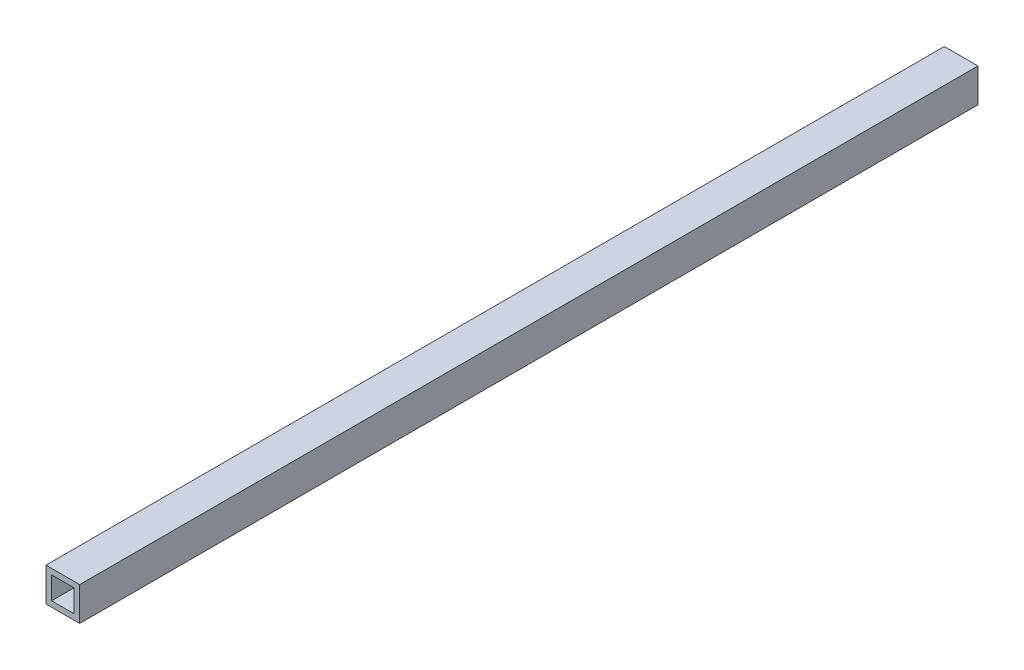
ISO-10303-21;
HEADER;
FILE_DESCRIPTION(('STEP AP214'),'2;1');
FILE_NAME('part.step','',(''),(''),'','','');
FILE_SCHEMA(('AUTOMOTIVE_DESIGN { 1 0 10303 214 1 1 1 1 }'));
ENDSEC;
DATA;
#1=APPLICATION_CONTEXT('core data for automotive mechanical design processes');
#2=APPLICATION_PROTOCOL_DEFINITION('international standard','automotive_design',2000,#1);
#3=PRODUCT_CONTEXT('',#1,'mechanical');
#4=PRODUCT('Part','Part','',(#3));
#5=PRODUCT_RELATED_PRODUCT_CATEGORY('part','',(#4));
#6=PRODUCT_DEFINITION_FORMATION('','',#4);
#7=PRODUCT_DEFINITION_CONTEXT('part definition',#1,'design');
#8=PRODUCT_DEFINITION('design','',#6,#7);
#9=PRODUCT_DEFINITION_SHAPE('','',#8);
#10=(LENGTH_UNIT() NAMED_UNIT(*) SI_UNIT(.MILLI.,.METRE.));
#11=(NAMED_UNIT(*) PLANE_ANGLE_UNIT() SI_UNIT($,.RADIAN.));
#12=(NAMED_UNIT(*) SI_UNIT($,.STERADIAN.) SOLID_ANGLE_UNIT());
#13=UNCERTAINTY_MEASURE_WITH_UNIT(LENGTH_MEASURE(1.E-05),#10,'distance_accuracy_value','');
#14=(GEOMETRIC_REPRESENTATION_CONTEXT(3) GLOBAL_UNCERTAINTY_ASSIGNED_CONTEXT((#13)) GLOBAL_UNIT_ASSIGNED_CONTEXT((#10,
#11,#12)) REPRESENTATION_CONTEXT('',''));
#15=CARTESIAN_POINT('',(0.,0.,0.));
#16=DIRECTION('',(0.,0.,1.));
#17=DIRECTION('',(1.,0.,0.));
#18=AXIS2_PLACEMENT_3D('',#15,#16,#17);
#19=CARTESIAN_POINT('',(9.525,-9.525,-508.));
#20=DIRECTION('',(1.,0.,0.));
#21=DIRECTION('',(0.,0.,-1.));
#22=AXIS2_PLACEMENT_3D('',#19,#20,#21);
#23=PLANE('',#22);
#24=DIRECTION('',(0.,1.,0.));
#25=VECTOR('',#24,1.);
#26=CARTESIAN_POINT('',(9.525,-9.525,0.));
#27=LINE('',#26,#25);
#28=CARTESIAN_POINT('',(9.525,-9.525,0.));
#29=VERTEX_POINT('',#28);
#30=CARTESIAN_POINT('',(9.525,9.525,0.));
#31=VERTEX_POINT('',#30);
#32=EDGE_CURVE('E183',#29,#31,#27,.T.);
#33=ORIENTED_EDGE('',*,*,#32,.F.);
#34=DIRECTION('',(0.,0.,1.));
#35=VECTOR('',#34,1.);
#36=CARTESIAN_POINT('',(9.525,-9.525,-508.));
#37=LINE('',#36,#35);
#38=CARTESIAN_POINT('',(9.525,-9.525,-508.));
#39=VERTEX_POINT('',#38);
#40=EDGE_CURVE('E11',#39,#29,#37,.T.);
#41=ORIENTED_EDGE('',*,*,#40,.F.);
#42=DIRECTION('',(0.,1.,0.));
#43=VECTOR('',#42,1.);
#44=CARTESIAN_POINT('',(9.525,-9.525,-508.));
#45=LINE('',#44,#43);
#46=CARTESIAN_POINT('',(9.525,9.525,-508.));
#47=VERTEX_POINT('',#46);
#48=EDGE_CURVE('E190',#39,#47,#45,.T.);
#49=ORIENTED_EDGE('',*,*,#48,.T.);
#50=DIRECTION('',(0.,0.,1.));
#51=VECTOR('',#50,1.);
#52=CARTESIAN_POINT('',(9.525,9.525,-508.));
#53=LINE('',#52,#51);
#54=EDGE_CURVE('E35',#47,#31,#53,.T.);
#55=ORIENTED_EDGE('',*,*,#54,.T.);
#56=EDGE_LOOP('',(#33,#41,#49,#55));
#57=FACE_BOUND('',#56,.T.);
#58=ADVANCED_FACE('F32',(#57),#23,.T.);
#59=CARTESIAN_POINT('',(-9.525,-9.525,-508.));
#60=DIRECTION('',(0.,-1.,0.));
#61=DIRECTION('',(0.,0.,-1.));
#62=AXIS2_PLACEMENT_3D('',#59,#60,#61);
#63=PLANE('',#62);
#64=DIRECTION('',(1.,0.,0.));
#65=VECTOR('',#64,1.);
#66=CARTESIAN_POINT('',(-9.525,-9.525,0.));
#67=LINE('',#66,#65);
#68=CARTESIAN_POINT('',(-9.525,-9.525,0.));
#69=VERTEX_POINT('',#68);
#70=EDGE_CURVE('E194',#69,#29,#67,.T.);
#71=ORIENTED_EDGE('',*,*,#70,.F.);
#72=DIRECTION('',(0.,0.,1.));
#73=VECTOR('',#72,1.);
#74=CARTESIAN_POINT('',(-9.525,-9.525,-508.));
#75=LINE('',#74,#73);
#76=CARTESIAN_POINT('',(-9.525,-9.525,-508.));
#77=VERTEX_POINT('',#76);
#78=EDGE_CURVE('E40',#77,#69,#75,.T.);
#79=ORIENTED_EDGE('',*,*,#78,.F.);
#80=DIRECTION('',(1.,0.,0.));
#81=VECTOR('',#80,1.);
#82=CARTESIAN_POINT('',(-9.525,-9.525,-508.));
#83=LINE('',#82,#81);
#84=EDGE_CURVE('E200',#77,#39,#83,.T.);
#85=ORIENTED_EDGE('',*,*,#84,.T.);
#86=ORIENTED_EDGE('',*,*,#40,.T.);
#87=EDGE_LOOP('',(#71,#79,#85,#86));
#88=FACE_BOUND('',#87,.T.);
#89=ADVANCED_FACE('F226',(#88),#63,.T.);
#90=CARTESIAN_POINT('',(-9.525,-9.525,-508.));
#91=DIRECTION('',(-1.,0.,0.));
#92=DIRECTION('',(0.,0.,1.));
#93=AXIS2_PLACEMENT_3D('',#90,#91,#92);
#94=PLANE('',#93);
#95=CARTESIAN_POINT('',(-9.525,0.,-482.6));
#96=DIRECTION('',(-1.,0.,0.));
#97=DIRECTION('',(0.,0.,1.));
#98=AXIS2_PLACEMENT_3D('',#95,#96,#97);
#99=CIRCLE('',#98,3.175);
#100=CARTESIAN_POINT('',(-9.525,3.175,-482.6));
#101=VERTEX_POINT('',#100);
#102=CARTESIAN_POINT('',(-9.525,-3.175,-482.6));
#103=VERTEX_POINT('',#102);
#104=EDGE_CURVE('E48',#101,#103,#99,.T.);
#105=ORIENTED_EDGE('',*,*,#104,.F.);
#106=DIRECTION('',(0.,0.,-1.));
#107=VECTOR('',#106,1.);
#108=CARTESIAN_POINT('',(-9.525,3.175,-482.6));
#109=LINE('',#108,#107);
#110=CARTESIAN_POINT('',(-9.525,3.175,-152.4));
#111=VERTEX_POINT('',#110);
#112=EDGE_CURVE('E129',#111,#101,#109,.T.);
#113=ORIENTED_EDGE('',*,*,#112,.F.);
#114=CARTESIAN_POINT('',(-9.525,0.,-152.4));
#115=DIRECTION('',(-1.,0.,0.));
#116=DIRECTION('',(0.,0.,1.));
#117=AXIS2_PLACEMENT_3D('',#114,#115,#116);
#118=CIRCLE('',#117,3.175);
#119=CARTESIAN_POINT('',(-9.525,-3.175,-152.4));
#120=VERTEX_POINT('',#119);
#121=EDGE_CURVE('E149',#120,#111,#118,.T.);
#122=ORIENTED_EDGE('',*,*,#121,.F.);
#123=DIRECTION('',(0.,0.,1.));
#124=VECTOR('',#123,1.);
#125=CARTESIAN_POINT('',(-9.525,-3.175,-482.6));
#126=LINE('',#125,#124);
#127=EDGE_CURVE('E143',#103,#120,#126,.T.);
#128=ORIENTED_EDGE('',*,*,#127,.F.);
#129=EDGE_LOOP('',(#105,#113,#122,#128));
#130=FACE_BOUND('',#129,.T.);
#131=DIRECTION('',(0.,-1.,0.));
#132=VECTOR('',#131,1.);
#133=CARTESIAN_POINT('',(-9.525,-9.525,0.));
#134=LINE('',#133,#132);
#135=CARTESIAN_POINT('',(-9.525,9.525,0.));
#136=VERTEX_POINT('',#135);
#137=EDGE_CURVE('E208',#136,#69,#134,.T.);
#138=ORIENTED_EDGE('',*,*,#137,.F.);
#139=DIRECTION('',(0.,0.,1.));
#140=VECTOR('',#139,1.);
#141=CARTESIAN_POINT('',(-9.525,9.525,-508.));
#142=LINE('',#141,#140);
#143=CARTESIAN_POINT('',(-9.525,9.525,-508.));
#144=VERTEX_POINT('',#143);
#145=EDGE_CURVE('E213',#144,#136,#142,.T.);
#146=ORIENTED_EDGE('',*,*,#145,.F.);
#147=DIRECTION('',(0.,-1.,0.));
#148=VECTOR('',#147,1.);
#149=CARTESIAN_POINT('',(-9.525,-9.525,-508.));
#150=LINE('',#149,#148);
#151=EDGE_CURVE('E197',#144,#77,#150,.T.);
#152=ORIENTED_EDGE('',*,*,#151,.T.);
#153=ORIENTED_EDGE('',*,*,#78,.T.);
#154=EDGE_LOOP('',(#138,#146,#152,#153));
#155=FACE_BOUND('',#154,.T.);
#156=ADVANCED_FACE('F232',(#130,#155),#94,.T.);
#157=CARTESIAN_POINT('',(-9.525,9.525,-508.));
#158=DIRECTION('',(0.,1.,0.));
#159=DIRECTION('',(0.,0.,1.));
#160=AXIS2_PLACEMENT_3D('',#157,#158,#159);
#161=PLANE('',#160);
#162=DIRECTION('',(-1.,0.,0.));
#163=VECTOR('',#162,1.);
#164=CARTESIAN_POINT('',(-9.525,9.525,0.));
#165=LINE('',#164,#163);
#166=EDGE_CURVE('E205',#31,#136,#165,.T.);
#167=ORIENTED_EDGE('',*,*,#166,.F.);
#168=ORIENTED_EDGE('',*,*,#54,.F.);
#169=DIRECTION('',(-1.,0.,0.));
#170=VECTOR('',#169,1.);
#171=CARTESIAN_POINT('',(-9.525,9.525,-508.));
#172=LINE('',#171,#170);
#173=EDGE_CURVE('E193',#47,#144,#172,.T.);
#174=ORIENTED_EDGE('',*,*,#173,.T.);
#175=ORIENTED_EDGE('',*,*,#145,.T.);
#176=EDGE_LOOP('',(#167,#168,#174,#175));
#177=FACE_BOUND('',#176,.T.);
#178=ADVANCED_FACE('F221',(#177),#161,.T.);
#179=CARTESIAN_POINT('',(0.,0.,-508.));
#180=DIRECTION('',(0.,0.,-1.));
#181=DIRECTION('',(-1.,0.,0.));
#182=AXIS2_PLACEMENT_3D('',#179,#180,#181);
#183=PLANE('',#182);
#184=DIRECTION('',(0.,-1.,0.));
#185=VECTOR('',#184,1.);
#186=CARTESIAN_POINT('',(-6.35,-6.35,-508.));
#187=LINE('',#186,#185);
#188=CARTESIAN_POINT('',(-6.35,6.35,-508.));
#189=VERTEX_POINT('',#188);
#190=CARTESIAN_POINT('',(-6.35,-6.35,-508.));
#191=VERTEX_POINT('',#190);
#192=EDGE_CURVE('E158',#189,#191,#187,.T.);
#193=ORIENTED_EDGE('',*,*,#192,.T.);
#194=DIRECTION('',(1.,0.,0.));
#195=VECTOR('',#194,1.);
#196=CARTESIAN_POINT('',(-6.35,-6.35,-508.));
#197=LINE('',#196,#195);
#198=CARTESIAN_POINT('',(6.35,-6.35,-508.));
#199=VERTEX_POINT('',#198);
#200=EDGE_CURVE('E161',#191,#199,#197,.T.);
#201=ORIENTED_EDGE('',*,*,#200,.T.);
#202=DIRECTION('',(0.,1.,0.));
#203=VECTOR('',#202,1.);
#204=CARTESIAN_POINT('',(6.35,-6.35,-508.));
#205=LINE('',#204,#203);
#206=CARTESIAN_POINT('',(6.35,6.35,-508.));
#207=VERTEX_POINT('',#206);
#208=EDGE_CURVE('E165',#199,#207,#205,.T.);
#209=ORIENTED_EDGE('',*,*,#208,.T.);
#210=DIRECTION('',(-1.,0.,0.));
#211=VECTOR('',#210,1.);
#212=CARTESIAN_POINT('',(-6.35,6.35,-508.));
#213=LINE('',#212,#211);
#214=EDGE_CURVE('E168',#207,#189,#213,.T.);
#215=ORIENTED_EDGE('',*,*,#214,.T.);
#216=EDGE_LOOP('',(#193,#201,#209,#215));
#217=FACE_BOUND('',#216,.T.);
#218=ORIENTED_EDGE('',*,*,#48,.F.);
#219=ORIENTED_EDGE('',*,*,#84,.F.);
#220=ORIENTED_EDGE('',*,*,#151,.F.);
#221=ORIENTED_EDGE('',*,*,#173,.F.);
#222=EDGE_LOOP('',(#218,#219,#220,#221));
#223=FACE_BOUND('',#222,.T.);
#224=ADVANCED_FACE('F229',(#217,#223),#183,.T.);
#225=CARTESIAN_POINT('',(0.,0.,0.));
#226=DIRECTION('',(0.,0.,-1.));
#227=DIRECTION('',(-1.,0.,0.));
#228=AXIS2_PLACEMENT_3D('',#225,#226,#227);
#229=PLANE('',#228);
#230=DIRECTION('',(1.,0.,0.));
#231=VECTOR('',#230,1.);
#232=CARTESIAN_POINT('',(-6.35,-6.35,0.));
#233=LINE('',#232,#231);
#234=CARTESIAN_POINT('',(-6.35,-6.35,0.));
#235=VERTEX_POINT('',#234);
#236=CARTESIAN_POINT('',(6.35,-6.35,0.));
#237=VERTEX_POINT('',#236);
#238=EDGE_CURVE('E173',#235,#237,#233,.T.);
#239=ORIENTED_EDGE('',*,*,#238,.F.);
#240=DIRECTION('',(0.,-1.,0.));
#241=VECTOR('',#240,1.);
#242=CARTESIAN_POINT('',(-6.35,-6.35,0.));
#243=LINE('',#242,#241);
#244=CARTESIAN_POINT('',(-6.35,6.35,0.));
#245=VERTEX_POINT('',#244);
#246=EDGE_CURVE('E135',#245,#235,#243,.T.);
#247=ORIENTED_EDGE('',*,*,#246,.F.);
#248=DIRECTION('',(-1.,0.,0.));
#249=VECTOR('',#248,1.);
#250=CARTESIAN_POINT('',(-6.35,6.35,0.));
#251=LINE('',#250,#249);
#252=CARTESIAN_POINT('',(6.35,6.35,0.));
#253=VERTEX_POINT('',#252);
#254=EDGE_CURVE('E162',#253,#245,#251,.T.);
#255=ORIENTED_EDGE('',*,*,#254,.F.);
#256=DIRECTION('',(0.,1.,0.));
#257=VECTOR('',#256,1.);
#258=CARTESIAN_POINT('',(6.35,-6.35,0.));
#259=LINE('',#258,#257);
#260=EDGE_CURVE('E176',#237,#253,#259,.T.);
#261=ORIENTED_EDGE('',*,*,#260,.F.);
#262=EDGE_LOOP('',(#239,#247,#255,#261));
#263=FACE_BOUND('',#262,.T.);
#264=ORIENTED_EDGE('',*,*,#32,.T.);
#265=ORIENTED_EDGE('',*,*,#166,.T.);
#266=ORIENTED_EDGE('',*,*,#137,.T.);
#267=ORIENTED_EDGE('',*,*,#70,.T.);
#268=EDGE_LOOP('',(#264,#265,#266,#267));
#269=FACE_BOUND('',#268,.T.);
#270=ADVANCED_FACE('F223',(#263,#269),#229,.F.);
#271=CARTESIAN_POINT('',(-6.35,-6.35,-508.));
#272=DIRECTION('',(-1.,0.,0.));
#273=DIRECTION('',(0.,0.,1.));
#274=AXIS2_PLACEMENT_3D('',#271,#272,#273);
#275=PLANE('',#274);
#276=DIRECTION('',(0.,0.,1.));
#277=VECTOR('',#276,1.);
#278=CARTESIAN_POINT('',(-6.35,3.175,-482.6));
#279=LINE('',#278,#277);
#280=CARTESIAN_POINT('',(-6.35,3.175,-482.6));
#281=VERTEX_POINT('',#280);
#282=CARTESIAN_POINT('',(-6.35,3.175,-152.4));
#283=VERTEX_POINT('',#282);
#284=EDGE_CURVE('E141',#281,#283,#279,.T.);
#285=ORIENTED_EDGE('',*,*,#284,.F.);
#286=CARTESIAN_POINT('',(-6.35,0.,-482.6));
#287=DIRECTION('',(-1.,0.,0.));
#288=DIRECTION('',(0.,0.,1.));
#289=AXIS2_PLACEMENT_3D('',#286,#287,#288);
#290=CIRCLE('',#289,3.175);
#291=CARTESIAN_POINT('',(-6.35,-3.175,-482.6));
#292=VERTEX_POINT('',#291);
#293=EDGE_CURVE('E123',#292,#281,#290,.F.);
#294=ORIENTED_EDGE('',*,*,#293,.F.);
#295=DIRECTION('',(0.,0.,-1.));
#296=VECTOR('',#295,1.);
#297=CARTESIAN_POINT('',(-6.35,-3.175,-482.6));
#298=LINE('',#297,#296);
#299=CARTESIAN_POINT('',(-6.35,-3.175,-152.4));
#300=VERTEX_POINT('',#299);
#301=EDGE_CURVE('E132',#300,#292,#298,.T.);
#302=ORIENTED_EDGE('',*,*,#301,.F.);
#303=CARTESIAN_POINT('',(-6.35,0.,-152.4));
#304=DIRECTION('',(-1.,0.,0.));
#305=DIRECTION('',(0.,0.,1.));
#306=AXIS2_PLACEMENT_3D('',#303,#304,#305);
#307=CIRCLE('',#306,3.175);
#308=EDGE_CURVE('E56',#283,#300,#307,.F.);
#309=ORIENTED_EDGE('',*,*,#308,.F.);
#310=EDGE_LOOP('',(#285,#294,#302,#309));
#311=FACE_BOUND('',#310,.T.);
#312=ORIENTED_EDGE('',*,*,#246,.T.);
#313=DIRECTION('',(0.,0.,1.));
#314=VECTOR('',#313,1.);
#315=CARTESIAN_POINT('',(-6.35,-6.35,-508.));
#316=LINE('',#315,#314);
#317=EDGE_CURVE('E171',#191,#235,#316,.T.);
#318=ORIENTED_EDGE('',*,*,#317,.F.);
#319=ORIENTED_EDGE('',*,*,#192,.F.);
#320=DIRECTION('',(0.,0.,1.));
#321=VECTOR('',#320,1.);
#322=CARTESIAN_POINT('',(-6.35,6.35,-508.));
#323=LINE('',#322,#321);
#324=EDGE_CURVE('E181',#189,#245,#323,.T.);
#325=ORIENTED_EDGE('',*,*,#324,.T.);
#326=EDGE_LOOP('',(#312,#318,#319,#325));
#327=FACE_BOUND('',#326,.T.);
#328=ADVANCED_FACE('F138',(#311,#327),#275,.F.);
#329=CARTESIAN_POINT('',(-6.35,6.35,-508.));
#330=DIRECTION('',(0.,1.,0.));
#331=DIRECTION('',(-1.,0.,0.));
#332=AXIS2_PLACEMENT_3D('',#329,#330,#331);
#333=PLANE('',#332);
#334=ORIENTED_EDGE('',*,*,#254,.T.);
#335=ORIENTED_EDGE('',*,*,#324,.F.);
#336=ORIENTED_EDGE('',*,*,#214,.F.);
#337=DIRECTION('',(0.,0.,1.));
#338=VECTOR('',#337,1.);
#339=CARTESIAN_POINT('',(6.35,6.35,-508.));
#340=LINE('',#339,#338);
#341=EDGE_CURVE('E184',#207,#253,#340,.T.);
#342=ORIENTED_EDGE('',*,*,#341,.T.);
#343=EDGE_LOOP('',(#334,#335,#336,#342));
#344=FACE_BOUND('',#343,.T.);
#345=ADVANCED_FACE('F279',(#344),#333,.F.);
#346=CARTESIAN_POINT('',(6.35,-6.35,-508.));
#347=DIRECTION('',(1.,0.,0.));
#348=DIRECTION('',(0.,1.,0.));
#349=AXIS2_PLACEMENT_3D('',#346,#347,#348);
#350=PLANE('',#349);
#351=ORIENTED_EDGE('',*,*,#260,.T.);
#352=ORIENTED_EDGE('',*,*,#341,.F.);
#353=ORIENTED_EDGE('',*,*,#208,.F.);
#354=DIRECTION('',(0.,0.,1.));
#355=VECTOR('',#354,1.);
#356=CARTESIAN_POINT('',(6.35,-6.35,-508.));
#357=LINE('',#356,#355);
#358=EDGE_CURVE('E186',#199,#237,#357,.T.);
#359=ORIENTED_EDGE('',*,*,#358,.T.);
#360=EDGE_LOOP('',(#351,#352,#353,#359));
#361=FACE_BOUND('',#360,.T.);
#362=ADVANCED_FACE('F288',(#361),#350,.F.);
#363=CARTESIAN_POINT('',(-6.35,-6.35,-508.));
#364=DIRECTION('',(0.,-1.,0.));
#365=DIRECTION('',(1.,0.,0.));
#366=AXIS2_PLACEMENT_3D('',#363,#364,#365);
#367=PLANE('',#366);
#368=ORIENTED_EDGE('',*,*,#238,.T.);
#369=ORIENTED_EDGE('',*,*,#358,.F.);
#370=ORIENTED_EDGE('',*,*,#200,.F.);
#371=ORIENTED_EDGE('',*,*,#317,.T.);
#372=EDGE_LOOP('',(#368,#369,#370,#371));
#373=FACE_BOUND('',#372,.T.);
#374=ADVANCED_FACE('F295',(#373),#367,.F.);
#375=CARTESIAN_POINT('',(9.526,0.,-482.6));
#376=DIRECTION('',(-1.,0.,0.));
#377=DIRECTION('',(0.,0.,1.));
#378=AXIS2_PLACEMENT_3D('',#375,#376,#377);
#379=CYLINDRICAL_SURFACE('',#378,3.175);
#380=ORIENTED_EDGE('',*,*,#293,.T.);
#381=DIRECTION('',(-1.,0.,0.));
#382=VECTOR('',#381,1.);
#383=CARTESIAN_POINT('',(9.526,3.175,-482.6));
#384=LINE('',#383,#382);
#385=EDGE_CURVE('E136',#281,#101,#384,.T.);
#386=ORIENTED_EDGE('',*,*,#385,.T.);
#387=ORIENTED_EDGE('',*,*,#104,.T.);
#388=DIRECTION('',(-1.,0.,0.));
#389=VECTOR('',#388,1.);
#390=CARTESIAN_POINT('',(9.526,-3.175,-482.6));
#391=LINE('',#390,#389);
#392=EDGE_CURVE('E119',#292,#103,#391,.T.);
#393=ORIENTED_EDGE('',*,*,#392,.F.);
#394=EDGE_LOOP('',(#380,#386,#387,#393));
#395=FACE_BOUND('',#394,.T.);
#396=ADVANCED_FACE('F121',(#395),#379,.F.);
#397=CARTESIAN_POINT('',(9.526,3.175,-482.6));
#398=DIRECTION('',(0.,1.,0.));
#399=DIRECTION('',(0.,0.,1.));
#400=AXIS2_PLACEMENT_3D('',#397,#398,#399);
#401=PLANE('',#400);
#402=ORIENTED_EDGE('',*,*,#284,.T.);
#403=DIRECTION('',(-1.,0.,0.));
#404=VECTOR('',#403,1.);
#405=CARTESIAN_POINT('',(9.526,3.175,-152.4));
#406=LINE('',#405,#404);
#407=EDGE_CURVE('E155',#283,#111,#406,.T.);
#408=ORIENTED_EDGE('',*,*,#407,.T.);
#409=ORIENTED_EDGE('',*,*,#112,.T.);
#410=ORIENTED_EDGE('',*,*,#385,.F.);
#411=EDGE_LOOP('',(#402,#408,#409,#410));
#412=FACE_BOUND('',#411,.T.);
#413=ADVANCED_FACE('F308',(#412),#401,.F.);
#414=CARTESIAN_POINT('',(9.526,0.,-152.4));
#415=DIRECTION('',(-1.,0.,0.));
#416=DIRECTION('',(0.,0.,1.));
#417=AXIS2_PLACEMENT_3D('',#414,#415,#416);
#418=CYLINDRICAL_SURFACE('',#417,3.175);
#419=ORIENTED_EDGE('',*,*,#308,.T.);
#420=DIRECTION('',(-1.,0.,0.));
#421=VECTOR('',#420,1.);
#422=CARTESIAN_POINT('',(9.526,-3.175,-152.4));
#423=LINE('',#422,#421);
#424=EDGE_CURVE('E128',#300,#120,#423,.T.);
#425=ORIENTED_EDGE('',*,*,#424,.T.);
#426=ORIENTED_EDGE('',*,*,#121,.T.);
#427=ORIENTED_EDGE('',*,*,#407,.F.);
#428=EDGE_LOOP('',(#419,#425,#426,#427));
#429=FACE_BOUND('',#428,.T.);
#430=ADVANCED_FACE('F315',(#429),#418,.F.);
#431=CARTESIAN_POINT('',(9.526,-3.175,-482.6));
#432=DIRECTION('',(0.,-1.,0.));
#433=DIRECTION('',(0.,0.,-1.));
#434=AXIS2_PLACEMENT_3D('',#431,#432,#433);
#435=PLANE('',#434);
#436=ORIENTED_EDGE('',*,*,#301,.T.);
#437=ORIENTED_EDGE('',*,*,#392,.T.);
#438=ORIENTED_EDGE('',*,*,#127,.T.);
#439=ORIENTED_EDGE('',*,*,#424,.F.);
#440=EDGE_LOOP('',(#436,#437,#438,#439));
#441=FACE_BOUND('',#440,.T.);
#442=ADVANCED_FACE('F133',(#441),#435,.F.);
#443=CLOSED_SHELL('',(#58,#89,#156,#178,#224,#270,#328,#345,#362,#374,#396,#413,#430,#442));
#444=MANIFOLD_SOLID_BREP('B2',#443);
#445=ADVANCED_BREP_SHAPE_REPRESENTATION('',(#18,#444),#14);
#446=SHAPE_DEFINITION_REPRESENTATION(#9,#445);
ENDSEC;
END-ISO-10303-21;
